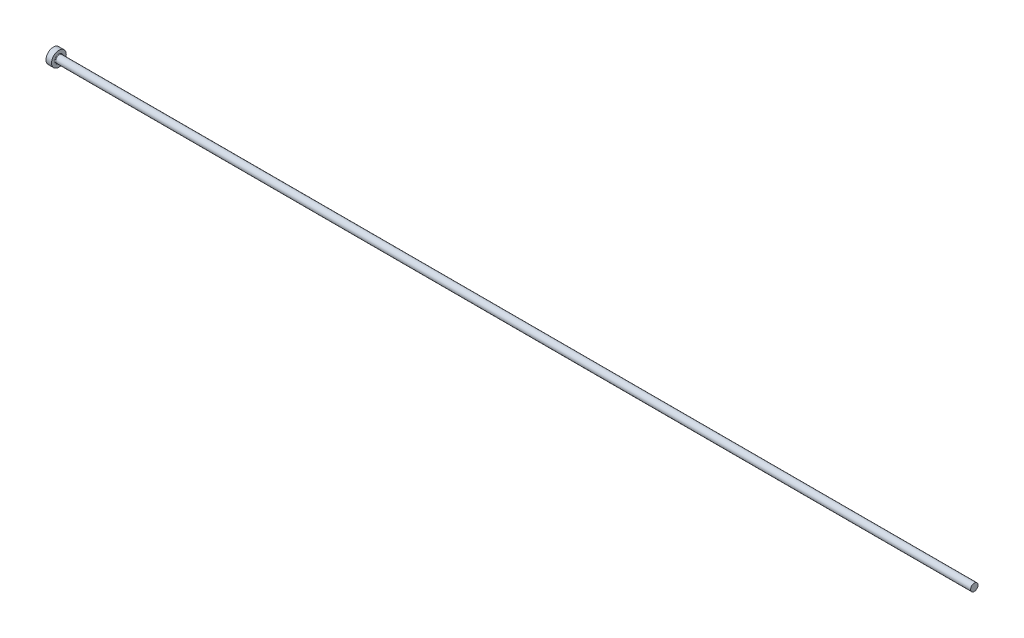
ISO-10303-21;
HEADER;
FILE_DESCRIPTION(('STEP AP214'),'2;1');
FILE_NAME('part.step','',(''),(''),'','','');
FILE_SCHEMA(('AUTOMOTIVE_DESIGN { 1 0 10303 214 1 1 1 1 }'));
ENDSEC;
DATA;
#1=APPLICATION_CONTEXT('core data for automotive mechanical design processes');
#2=APPLICATION_PROTOCOL_DEFINITION('international standard','automotive_design',2000,#1);
#3=PRODUCT_CONTEXT('',#1,'mechanical');
#4=PRODUCT('Part','Part','',(#3));
#5=PRODUCT_RELATED_PRODUCT_CATEGORY('part','',(#4));
#6=PRODUCT_DEFINITION_FORMATION('','',#4);
#7=PRODUCT_DEFINITION_CONTEXT('part definition',#1,'design');
#8=PRODUCT_DEFINITION('design','',#6,#7);
#9=PRODUCT_DEFINITION_SHAPE('','',#8);
#10=(LENGTH_UNIT() NAMED_UNIT(*) SI_UNIT(.MILLI.,.METRE.));
#11=(NAMED_UNIT(*) PLANE_ANGLE_UNIT() SI_UNIT($,.RADIAN.));
#12=(NAMED_UNIT(*) SI_UNIT($,.STERADIAN.) SOLID_ANGLE_UNIT());
#13=UNCERTAINTY_MEASURE_WITH_UNIT(LENGTH_MEASURE(1.E-05),#10,'distance_accuracy_value','');
#14=(GEOMETRIC_REPRESENTATION_CONTEXT(3) GLOBAL_UNCERTAINTY_ASSIGNED_CONTEXT((#13)) GLOBAL_UNIT_ASSIGNED_CONTEXT((#10,
#11,#12)) REPRESENTATION_CONTEXT('',''));
#15=CARTESIAN_POINT('',(0.,0.,0.));
#16=DIRECTION('',(0.,0.,1.));
#17=DIRECTION('',(1.,0.,0.));
#18=AXIS2_PLACEMENT_3D('',#15,#16,#17);
#19=CARTESIAN_POINT('',(0.,0.,0.));
#20=DIRECTION('',(-1.,0.,0.));
#21=DIRECTION('',(0.,-1.,0.));
#22=AXIS2_PLACEMENT_3D('',#19,#20,#21);
#23=PLANE('',#22);
#24=CARTESIAN_POINT('',(0.,0.,0.));
#25=DIRECTION('',(1.,0.,0.));
#26=DIRECTION('',(0.,1.,0.));
#27=AXIS2_PLACEMENT_3D('',#24,#25,#26);
#28=CIRCLE('',#27,4.);
#29=CARTESIAN_POINT('',(0.,4.,0.));
#30=VERTEX_POINT('',#29);
#31=EDGE_CURVE('E25',#30,#30,#28,.T.);
#32=ORIENTED_EDGE('',*,*,#31,.F.);
#33=EDGE_LOOP('',(#32));
#34=FACE_BOUND('',#33,.T.);
#35=ADVANCED_FACE('F14',(#34),#23,.T.);
#36=CARTESIAN_POINT('',(500.,0.,0.));
#37=DIRECTION('',(1.,0.,0.));
#38=DIRECTION('',(0.,1.,0.));
#39=AXIS2_PLACEMENT_3D('',#36,#37,#38);
#40=CYLINDRICAL_SURFACE('',#39,4.);
#41=ORIENTED_EDGE('',*,*,#31,.T.);
#42=EDGE_LOOP('',(#41));
#43=FACE_BOUND('',#42,.T.);
#44=CARTESIAN_POINT('',(3.,0.,0.));
#45=DIRECTION('',(1.,0.,0.));
#46=DIRECTION('',(0.,1.,0.));
#47=AXIS2_PLACEMENT_3D('',#44,#45,#46);
#48=CIRCLE('',#47,4.);
#49=CARTESIAN_POINT('',(3.,4.,0.));
#50=VERTEX_POINT('',#49);
#51=EDGE_CURVE('E29',#50,#50,#48,.T.);
#52=ORIENTED_EDGE('',*,*,#51,.F.);
#53=EDGE_LOOP('',(#52));
#54=FACE_BOUND('',#53,.T.);
#55=ADVANCED_FACE('F51',(#43,#54),#40,.T.);
#56=CARTESIAN_POINT('',(3.,4.,0.));
#57=DIRECTION('',(1.,0.,0.));
#58=DIRECTION('',(0.,1.,0.));
#59=AXIS2_PLACEMENT_3D('',#56,#57,#58);
#60=PLANE('',#59);
#61=CARTESIAN_POINT('',(3.,0.,0.));
#62=DIRECTION('',(1.,0.,0.));
#63=DIRECTION('',(0.,1.,0.));
#64=AXIS2_PLACEMENT_3D('',#61,#62,#63);
#65=CIRCLE('',#64,2.29999999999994);
#66=CARTESIAN_POINT('',(3.,2.29999999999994,0.));
#67=VERTEX_POINT('',#66);
#68=EDGE_CURVE('E9',#67,#67,#65,.F.);
#69=ORIENTED_EDGE('',*,*,#68,.T.);
#70=EDGE_LOOP('',(#69));
#71=FACE_BOUND('',#70,.T.);
#72=ORIENTED_EDGE('',*,*,#51,.T.);
#73=EDGE_LOOP('',(#72));
#74=FACE_BOUND('',#73,.T.);
#75=ADVANCED_FACE('F42',(#71,#74),#60,.T.);
#76=CARTESIAN_POINT('',(500.,0.,0.));
#77=DIRECTION('',(1.,0.,0.));
#78=DIRECTION('',(0.,1.,0.));
#79=AXIS2_PLACEMENT_3D('',#76,#77,#78);
#80=CYLINDRICAL_SURFACE('',#79,1.99999999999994);
#81=CARTESIAN_POINT('',(3.3,0.,0.));
#82=DIRECTION('',(1.,0.,0.));
#83=DIRECTION('',(0.,1.,0.));
#84=AXIS2_PLACEMENT_3D('',#81,#82,#83);
#85=CIRCLE('',#84,1.99999999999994);
#86=CARTESIAN_POINT('',(3.3,1.99999999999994,0.));
#87=VERTEX_POINT('',#86);
#88=EDGE_CURVE('E21',#87,#87,#85,.T.);
#89=ORIENTED_EDGE('',*,*,#88,.T.);
#90=EDGE_LOOP('',(#89));
#91=FACE_BOUND('',#90,.T.);
#92=CARTESIAN_POINT('',(500.,0.,0.));
#93=DIRECTION('',(1.,0.,0.));
#94=DIRECTION('',(0.,1.,0.));
#95=AXIS2_PLACEMENT_3D('',#92,#93,#94);
#96=CIRCLE('',#95,1.99999999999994);
#97=CARTESIAN_POINT('',(500.,1.99999999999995,0.));
#98=VERTEX_POINT('',#97);
#99=EDGE_CURVE('E34',#98,#98,#96,.T.);
#100=ORIENTED_EDGE('',*,*,#99,.F.);
#101=EDGE_LOOP('',(#100));
#102=FACE_BOUND('',#101,.T.);
#103=ADVANCED_FACE('F40',(#91,#102),#80,.T.);
#104=CARTESIAN_POINT('',(500.,1.99999999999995,0.));
#105=DIRECTION('',(1.,0.,0.));
#106=DIRECTION('',(0.,1.,0.));
#107=AXIS2_PLACEMENT_3D('',#104,#105,#106);
#108=PLANE('',#107);
#109=ORIENTED_EDGE('',*,*,#99,.T.);
#110=EDGE_LOOP('',(#109));
#111=FACE_BOUND('',#110,.T.);
#112=ADVANCED_FACE('F38',(#111),#108,.T.);
#113=CARTESIAN_POINT('',(3.3,0.,0.));
#114=DIRECTION('',(1.,0.,0.));
#115=DIRECTION('',(0.,1.,0.));
#116=AXIS2_PLACEMENT_3D('',#113,#114,#115);
#117=TOROIDAL_SURFACE('',#116,2.29999999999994,0.3);
#118=ORIENTED_EDGE('',*,*,#68,.F.);
#119=EDGE_LOOP('',(#118));
#120=FACE_BOUND('',#119,.T.);
#121=ORIENTED_EDGE('',*,*,#88,.F.);
#122=EDGE_LOOP('',(#121));
#123=FACE_BOUND('',#122,.T.);
#124=ADVANCED_FACE('F16',(#120,#123),#117,.F.);
#125=CLOSED_SHELL('',(#35,#55,#75,#103,#112,#124));
#126=MANIFOLD_SOLID_BREP('B1',#125);
#127=ADVANCED_BREP_SHAPE_REPRESENTATION('',(#18,#126),#14);
#128=SHAPE_DEFINITION_REPRESENTATION(#9,#127);
ENDSEC;
END-ISO-10303-21;
